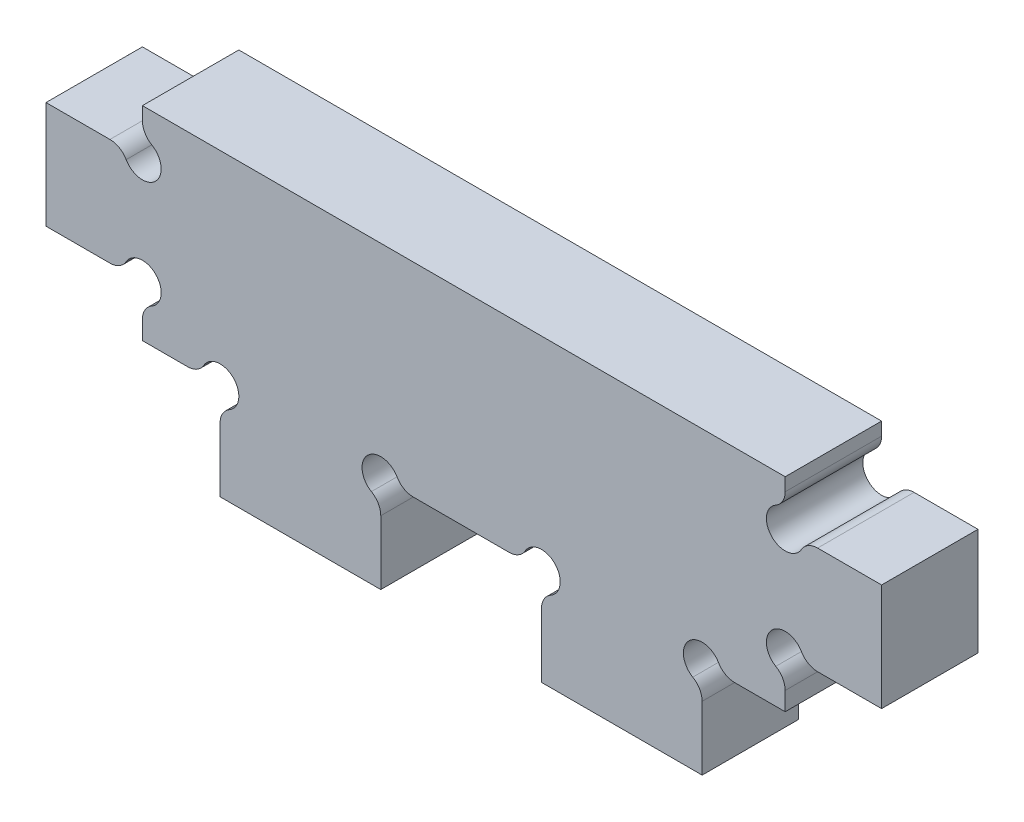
from build123d import *

# Parameters (mm, degrees)
BOSS_EXTRUDE1_DEPTH     = 18
SKETCH3_W               = 30
SKETCH3_H               = 36
BOSS_EXTRUDE3_DEPTH     = 18
CUT_EXTRUDE1_DEPTH      = 89.839743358
CUT_EXTRUDE1_DEPTH_BACK = 89.839743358
SKETCH4_R               = 3.5
FILLET1_R               = 3.5


with BuildPart() as part:
    # Sketch1 → Boss-Extrude1 (new body)
    with BuildSketch(Plane.XY):
        Polygon((-59.5, 18.5), (60.5, 18.5), (60.5, 11.658312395), (60.5, 10), (61, 10), (78.5, 10), (78.5, -10), (63.5, -10), (60.5, -10), (60.5, -13), (60.5, -19.5), (-59.5, -19.5), (-59.5, -13), (-59.5, -10), (-62.5, -10), (-77.5, -10), (-77.5, 10), (-60, 10), (-59.5, 10), (-59.5, 11.658312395), align=None)
    extrude(amount=BOSS_EXTRUDE1_DEPTH)

    # Sketch3 → Boss-Extrude3 (add)
    with BuildSketch(Plane.XY.offset(18)):
        with Locations((-30, -19.5)):
            Rectangle(SKETCH3_W, SKETCH3_H)
        with Locations((30, -19.5)):
            Rectangle(SKETCH3_W, SKETCH3_H)
    extrude(amount=-BOSS_EXTRUDE3_DEPTH)

    # Sketch4 → Cut-Extrude1 (cut, two sides: drawn at the far end of the back side and taken through both)
    with BuildSketch(Plane.XY.offset(18).offset(-CUT_EXTRUDE1_DEPTH_BACK)):
        with Locations((-45, -19.5)):
            Circle(SKETCH4_R)
        with Locations((-15, -19.5)):
            Circle(SKETCH4_R)
        with Locations((15, -19.5)):
            Circle(SKETCH4_R)
        with Locations((45, -19.5)):
            Circle(SKETCH4_R)
        with Locations((-59.5, 10)):
            Circle(SKETCH4_R)
        with Locations((-59.5, -10)):
            Circle(SKETCH4_R)
        with Locations((60.5, 10)):
            Circle(SKETCH4_R)
        with Locations((60.5, -10)):
            Circle(SKETCH4_R)
    extrude(amount=CUT_EXTRUDE1_DEPTH + CUT_EXTRUDE1_DEPTH_BACK, mode=Mode.SUBTRACT)

    # Fillet1
    fillet1_edges = [part.edges().sort_by_distance(p)[0] for p in [
        (-48.5, -19.5, 9),
        (15, -23, 9),
        (45, -23, 9),
        (-15, -23, 9),
        (-11.5, -19.5, 9),
        (11.5, -19.5, 9),
        (48.5, -19.5, 9),
        (-59.5, 13.5, 9),
        (-63, 10, 9),
        (-59.5, -13.5, 9),
        (-63, -10, 9),
        (64, 10, 9),
        (60.5, 13.5, 9),
        (60.5, -13.5, 9),
        (64, -10, 9),
        (-45, -23, 9),
    ]]
    fillet(fillet1_edges, radius=FILLET1_R)


solid = part.part
